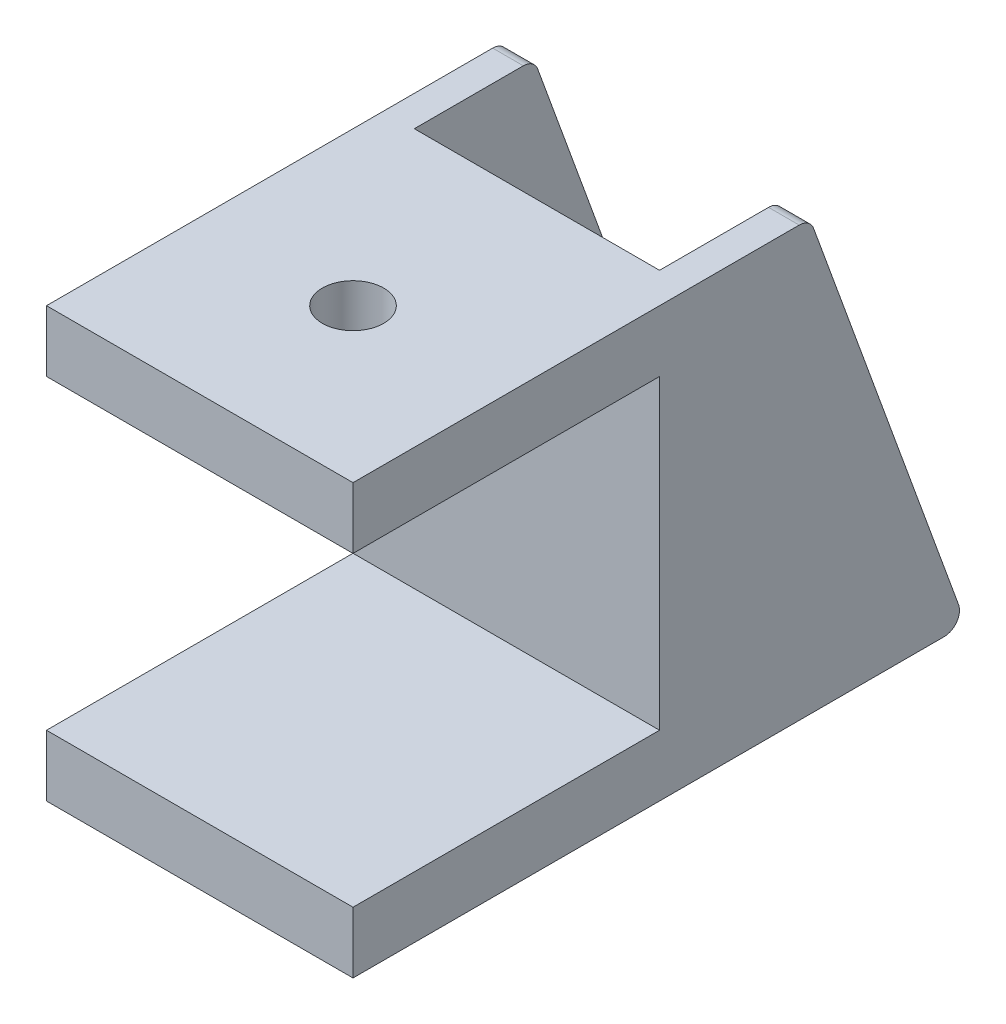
from build123d import *

# Parameters (mm, degrees)
BOSS_EXTRUDE3_DEPTH = 20
SKETCH13_R          = 2
CUT_EXTRUDE4_DEPTH  = 5
CUT_EXTRUDE5_DEPTH  = 20
FILLET1_R           = 1
CUT_EXTRUDE6_DEPTH  = 20
FILLET2_R           = 1


with BuildPart() as part:
    # Sketch7 → Boss-Extrude3 (new body)
    with BuildSketch(Plane(origin=(0, 0, 0), x_dir=(0, 0, -1), z_dir=(1, 0, 0))):
        Polygon((-29.812473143, 23.99), (-29.812473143, 19.99), (-9.812473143, 19.99), (-9.812473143, 0), (-29.812473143, 0), (-29.812473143, -4), (10.187526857, -4), (0, 23.99), align=None)
    extrude(amount=BOSS_EXTRUDE3_DEPTH)

    # Sketch13 → Cut-Extrude4 (cut)
    with BuildSketch(Plane(origin=(0, 23.99, 0), x_dir=(1, 0, 0), z_dir=(0, 1, 0))):
        with Locations(Location((10, -19.812473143, 0), (0, 0, 270))):
            Circle(SKETCH13_R)
    extrude(amount=-CUT_EXTRUDE4_DEPTH, mode=Mode.SUBTRACT)

    # Sketch16 → Cut-Extrude5 (cut)
    with BuildSketch(Plane(origin=(0, 23.99, 0), x_dir=(1, 0, 0), z_dir=(0, 1, 0))):
        Polygon((2, 10.187526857), (2, -7.812473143), (18, -7.812473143), (18, 10.187526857), (18, 13.187526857), (2, 13.187526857), align=None)
    extrude(amount=-CUT_EXTRUDE5_DEPTH, mode=Mode.SUBTRACT)

    # Fillet1
    fillet1_edges = [part.edges().sort_by_distance(p)[0] for p in [
        (19, 23.99, 0),
        (1, 23.99, 0),
    ]]
    fillet(fillet1_edges, radius=FILLET1_R)

    # Sketch17 → Cut-Extrude6 (cut)
    with BuildSketch(Plane(origin=(0, 3.99, 0), x_dir=(1, 0, 0), z_dir=(0, 1, 0))):
        with BuildLine():
            Line((14.1, 2.727526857), (14.1, -3.272473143))
            ThreePointArc((14.1, -3.272473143), (10, -7.372473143), (5.9, -3.272473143))
            Line((5.9, -3.272473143), (5.9, 2.727526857))
            ThreePointArc((5.9, 2.727526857), (10, 6.827526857), (14.1, 2.727526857))
        make_face()
    extrude(amount=-CUT_EXTRUDE6_DEPTH, mode=Mode.SUBTRACT)

    # Fillet2
    fillet2_edges = [part.edges().sort_by_distance(p)[0] for p in [
        (10, -4, -10.187526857),
    ]]
    fillet(fillet2_edges, radius=FILLET2_R)


solid = part.part
